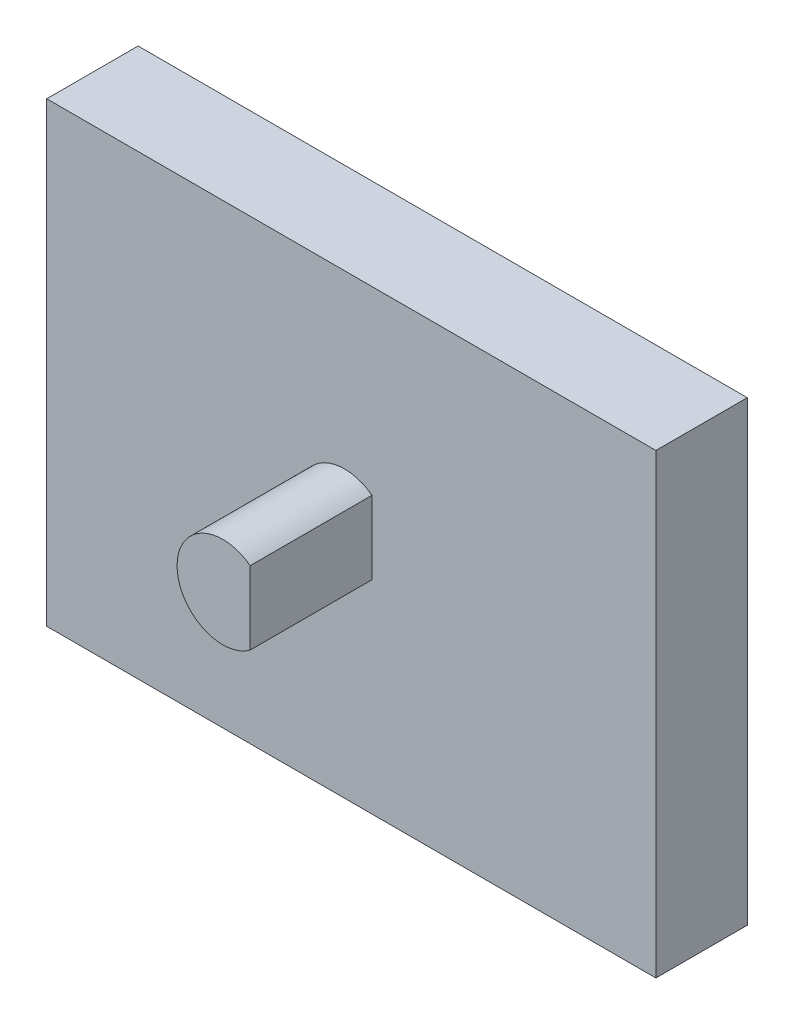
from build123d import *

# Parameters (mm, degrees)
SKETCH1_W          = 100
SKETCH1_H          = 75
EXTRUDE1_DEPTH     = 15
SKETCH2_R          = 7.5
EXTRUDE2_DEPTH     = 20
CUT_EXTRUDE1_START = -20
CUT_EXTRUDE1_DEPTH = 20


with BuildPart() as part:
    # Sketch1 → Extrude1 (new body)
    with BuildSketch(Plane.XY):
        with Locations((50, 37.5)):
            Rectangle(SKETCH1_W, SKETCH1_H)
    extrude(amount=EXTRUDE1_DEPTH)

    # Sketch2 → Extrude2 (add)
    with BuildSketch(Plane.XY.offset(15)):
        with Locations(Location((48.896428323, 39.320625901, 0), (0, 0, 180))):
            Circle(SKETCH2_R)
    extrude(amount=EXTRUDE2_DEPTH)

    # Sketch3 → Cut-Extrude1 (cut)
    with BuildSketch(Plane.XY.offset(35).offset(CUT_EXTRUDE1_START)):
        with BuildLine():
            Line((53.396428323, 45.320625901), (53.396428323, 33.320625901))
            ThreePointArc((53.396428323, 33.320625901), (56.396428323, 39.320625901), (53.396428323, 45.320625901))
        make_face()
    extrude(amount=CUT_EXTRUDE1_DEPTH, mode=Mode.SUBTRACT)


solid = part.part
